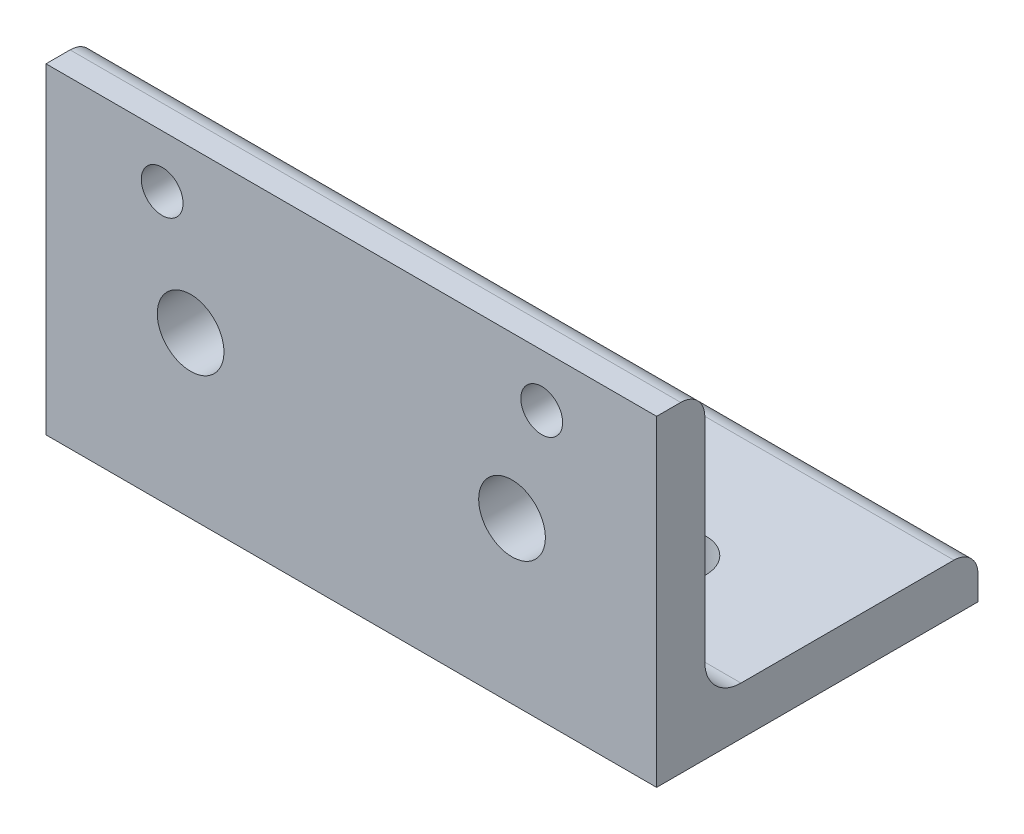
ISO-10303-21;
HEADER;
FILE_DESCRIPTION(('STEP AP214'),'2;1');
FILE_NAME('part.step','',(''),(''),'','','');
FILE_SCHEMA(('AUTOMOTIVE_DESIGN { 1 0 10303 214 1 1 1 1 }'));
ENDSEC;
DATA;
#1=APPLICATION_CONTEXT('core data for automotive mechanical design processes');
#2=APPLICATION_PROTOCOL_DEFINITION('international standard','automotive_design',2000,#1);
#3=PRODUCT_CONTEXT('',#1,'mechanical');
#4=PRODUCT('Part','Part','',(#3));
#5=PRODUCT_RELATED_PRODUCT_CATEGORY('part','',(#4));
#6=PRODUCT_DEFINITION_FORMATION('','',#4);
#7=PRODUCT_DEFINITION_CONTEXT('part definition',#1,'design');
#8=PRODUCT_DEFINITION('design','',#6,#7);
#9=PRODUCT_DEFINITION_SHAPE('','',#8);
#10=(LENGTH_UNIT() NAMED_UNIT(*) SI_UNIT(.MILLI.,.METRE.));
#11=(NAMED_UNIT(*) PLANE_ANGLE_UNIT() SI_UNIT($,.RADIAN.));
#12=(NAMED_UNIT(*) SI_UNIT($,.STERADIAN.) SOLID_ANGLE_UNIT());
#13=UNCERTAINTY_MEASURE_WITH_UNIT(LENGTH_MEASURE(1.E-05),#10,'distance_accuracy_value','');
#14=(GEOMETRIC_REPRESENTATION_CONTEXT(3) GLOBAL_UNCERTAINTY_ASSIGNED_CONTEXT((#13)) GLOBAL_UNIT_ASSIGNED_CONTEXT((#10,
#11,#12)) REPRESENTATION_CONTEXT('',''));
#15=CARTESIAN_POINT('',(0.,0.,0.));
#16=DIRECTION('',(0.,0.,1.));
#17=DIRECTION('',(1.,0.,0.));
#18=AXIS2_PLACEMENT_3D('',#15,#16,#17);
#19=CARTESIAN_POINT('',(0.,5.99999999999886,-5.99999999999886));
#20=DIRECTION('',(0.,-1.,0.));
#21=DIRECTION('',(0.,0.,-1.));
#22=AXIS2_PLACEMENT_3D('',#19,#20,#21);
#23=PLANE('',#22);
#24=CARTESIAN_POINT('',(17.9999999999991,5.99999999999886,-19.9999999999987));
#25=DIRECTION('',(0.,1.,0.));
#26=DIRECTION('',(0.,0.,1.));
#27=AXIS2_PLACEMENT_3D('',#24,#25,#26);
#28=CIRCLE('',#27,4.15000000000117);
#29=CARTESIAN_POINT('',(17.9999999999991,5.99999999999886,-15.8499999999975));
#30=VERTEX_POINT('',#29);
#31=EDGE_CURVE('E210',#30,#30,#28,.T.);
#32=ORIENTED_EDGE('',*,*,#31,.F.);
#33=EDGE_LOOP('',(#32));
#34=FACE_BOUND('',#33,.T.);
#35=DIRECTION('',(0.,0.,-1.));
#36=VECTOR('',#35,1.);
#37=CARTESIAN_POINT('',(76.0000000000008,5.99999999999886,-5.99999999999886));
#38=LINE('',#37,#36);
#39=CARTESIAN_POINT('',(76.0000000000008,5.99999999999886,-10.4999999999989));
#40=VERTEX_POINT('',#39);
#41=CARTESIAN_POINT('',(76.0000000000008,5.99999999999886,-36.999999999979));
#42=VERTEX_POINT('',#41);
#43=EDGE_CURVE('E148',#40,#42,#38,.T.);
#44=ORIENTED_EDGE('',*,*,#43,.T.);
#45=DIRECTION('',(1.,0.,0.));
#46=VECTOR('',#45,1.);
#47=CARTESIAN_POINT('',(0.,5.99999999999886,-36.999999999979));
#48=LINE('',#47,#46);
#49=CARTESIAN_POINT('',(0.,5.99999999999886,-36.999999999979));
#50=VERTEX_POINT('',#49);
#51=EDGE_CURVE('E178',#42,#50,#48,.F.);
#52=ORIENTED_EDGE('',*,*,#51,.T.);
#53=DIRECTION('',(0.,0.,-1.));
#54=VECTOR('',#53,1.);
#55=CARTESIAN_POINT('',(0.,5.99999999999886,-5.99999999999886));
#56=LINE('',#55,#54);
#57=CARTESIAN_POINT('',(0.,5.99999999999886,-10.4999999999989));
#58=VERTEX_POINT('',#57);
#59=EDGE_CURVE('E154',#58,#50,#56,.T.);
#60=ORIENTED_EDGE('',*,*,#59,.F.);
#61=DIRECTION('',(1.,0.,0.));
#62=VECTOR('',#61,1.);
#63=CARTESIAN_POINT('',(76.0000000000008,5.99999999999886,-10.4999999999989));
#64=LINE('',#63,#62);
#65=EDGE_CURVE('E159',#58,#40,#64,.T.);
#66=ORIENTED_EDGE('',*,*,#65,.T.);
#67=EDGE_LOOP('',(#44,#52,#60,#66));
#68=FACE_BOUND('',#67,.T.);
#69=CARTESIAN_POINT('',(57.9999999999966,5.99999999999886,-19.9999999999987));
#70=DIRECTION('',(0.,1.,0.));
#71=DIRECTION('',(0.,0.,1.));
#72=AXIS2_PLACEMENT_3D('',#69,#70,#71);
#73=CIRCLE('',#72,4.15000000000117);
#74=CARTESIAN_POINT('',(57.9999999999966,5.99999999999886,-15.8499999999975));
#75=VERTEX_POINT('',#74);
#76=EDGE_CURVE('E216',#75,#75,#73,.T.);
#77=ORIENTED_EDGE('',*,*,#76,.F.);
#78=EDGE_LOOP('',(#77));
#79=FACE_BOUND('',#78,.T.);
#80=ADVANCED_FACE('F45',(#34,#68,#79),#23,.F.);
#81=CARTESIAN_POINT('',(0.,0.,-39.9999999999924));
#82=DIRECTION('',(0.,-1.,0.));
#83=DIRECTION('',(0.,0.,-1.));
#84=AXIS2_PLACEMENT_3D('',#81,#82,#83);
#85=PLANE('',#84);
#86=CARTESIAN_POINT('',(17.9999999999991,0.,-19.9999999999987));
#87=DIRECTION('',(0.,1.,0.));
#88=DIRECTION('',(0.,0.,1.));
#89=AXIS2_PLACEMENT_3D('',#86,#87,#88);
#90=CIRCLE('',#89,4.15000000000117);
#91=CARTESIAN_POINT('',(17.9999999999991,0.,-15.8499999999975));
#92=VERTEX_POINT('',#91);
#93=EDGE_CURVE('E213',#92,#92,#90,.T.);
#94=ORIENTED_EDGE('',*,*,#93,.T.);
#95=EDGE_LOOP('',(#94));
#96=FACE_BOUND('',#95,.T.);
#97=CARTESIAN_POINT('',(57.9999999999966,0.,-19.9999999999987));
#98=DIRECTION('',(0.,1.,0.));
#99=DIRECTION('',(0.,0.,1.));
#100=AXIS2_PLACEMENT_3D('',#97,#98,#99);
#101=CIRCLE('',#100,4.15000000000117);
#102=CARTESIAN_POINT('',(57.9999999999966,0.,-15.8499999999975));
#103=VERTEX_POINT('',#102);
#104=EDGE_CURVE('E219',#103,#103,#101,.T.);
#105=ORIENTED_EDGE('',*,*,#104,.T.);
#106=EDGE_LOOP('',(#105));
#107=FACE_BOUND('',#106,.T.);
#108=DIRECTION('',(1.,0.,0.));
#109=VECTOR('',#108,1.);
#110=CARTESIAN_POINT('',(0.,0.,0.));
#111=LINE('',#110,#109);
#112=CARTESIAN_POINT('',(0.,0.,0.));
#113=VERTEX_POINT('',#112);
#114=CARTESIAN_POINT('',(76.0000000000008,0.,0.));
#115=VERTEX_POINT('',#114);
#116=EDGE_CURVE('E152',#113,#115,#111,.T.);
#117=ORIENTED_EDGE('',*,*,#116,.F.);
#118=DIRECTION('',(0.,0.,1.));
#119=VECTOR('',#118,1.);
#120=CARTESIAN_POINT('',(0.,0.,-39.9999999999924));
#121=LINE('',#120,#119);
#122=CARTESIAN_POINT('',(0.,0.,-39.9999999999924));
#123=VERTEX_POINT('',#122);
#124=EDGE_CURVE('E141',#123,#113,#121,.T.);
#125=ORIENTED_EDGE('',*,*,#124,.F.);
#126=DIRECTION('',(1.,0.,0.));
#127=VECTOR('',#126,1.);
#128=CARTESIAN_POINT('',(0.,0.,-39.9999999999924));
#129=LINE('',#128,#127);
#130=CARTESIAN_POINT('',(76.0000000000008,0.,-39.9999999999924));
#131=VERTEX_POINT('',#130);
#132=EDGE_CURVE('E135',#123,#131,#129,.T.);
#133=ORIENTED_EDGE('',*,*,#132,.T.);
#134=DIRECTION('',(0.,0.,1.));
#135=VECTOR('',#134,1.);
#136=CARTESIAN_POINT('',(76.0000000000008,0.,-39.9999999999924));
#137=LINE('',#136,#135);
#138=EDGE_CURVE('E117',#131,#115,#137,.T.);
#139=ORIENTED_EDGE('',*,*,#138,.T.);
#140=EDGE_LOOP('',(#117,#125,#133,#139));
#141=FACE_BOUND('',#140,.T.);
#142=ADVANCED_FACE('F140',(#96,#107,#141),#85,.T.);
#143=CARTESIAN_POINT('',(0.,39.9999999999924,-39.9999999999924));
#144=DIRECTION('',(-1.,0.,0.));
#145=DIRECTION('',(0.,0.,1.));
#146=AXIS2_PLACEMENT_3D('',#143,#144,#145);
#147=PLANE('',#146);
#148=ORIENTED_EDGE('',*,*,#59,.T.);
#149=CARTESIAN_POINT('',(0.,2.99999999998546,-36.999999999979));
#150=DIRECTION('',(-1.,0.,0.));
#151=DIRECTION('',(0.,0.,1.));
#152=AXIS2_PLACEMENT_3D('',#149,#150,#151);
#153=CIRCLE('',#152,3.0000000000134);
#154=CARTESIAN_POINT('',(0.,2.99999999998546,-39.9999999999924));
#155=VERTEX_POINT('',#154);
#156=EDGE_CURVE('E181',#50,#155,#153,.T.);
#157=ORIENTED_EDGE('',*,*,#156,.T.);
#158=DIRECTION('',(0.,-1.,0.));
#159=VECTOR('',#158,1.);
#160=CARTESIAN_POINT('',(0.,39.9999999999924,-39.9999999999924));
#161=LINE('',#160,#159);
#162=EDGE_CURVE('E128',#155,#123,#161,.T.);
#163=ORIENTED_EDGE('',*,*,#162,.T.);
#164=ORIENTED_EDGE('',*,*,#124,.T.);
#165=DIRECTION('',(0.,-1.,0.));
#166=VECTOR('',#165,1.);
#167=CARTESIAN_POINT('',(0.,39.9999999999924,0.));
#168=LINE('',#167,#166);
#169=CARTESIAN_POINT('',(0.,39.9999999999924,0.));
#170=VERTEX_POINT('',#169);
#171=EDGE_CURVE('E142',#170,#113,#168,.T.);
#172=ORIENTED_EDGE('',*,*,#171,.F.);
#173=DIRECTION('',(0.,0.,1.));
#174=VECTOR('',#173,1.);
#175=CARTESIAN_POINT('',(0.,39.9999999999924,-39.9999999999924));
#176=LINE('',#175,#174);
#177=CARTESIAN_POINT('',(0.,39.9999999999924,-2.99999999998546));
#178=VERTEX_POINT('',#177);
#179=EDGE_CURVE('E160',#178,#170,#176,.T.);
#180=ORIENTED_EDGE('',*,*,#179,.F.);
#181=CARTESIAN_POINT('',(0.,36.999999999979,-2.99999999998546));
#182=DIRECTION('',(-1.,0.,0.));
#183=DIRECTION('',(0.,0.,1.));
#184=AXIS2_PLACEMENT_3D('',#181,#182,#183);
#185=CIRCLE('',#184,3.0000000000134);
#186=CARTESIAN_POINT('',(0.,36.999999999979,-5.99999999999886));
#187=VERTEX_POINT('',#186);
#188=EDGE_CURVE('E67',#178,#187,#185,.T.);
#189=ORIENTED_EDGE('',*,*,#188,.T.);
#190=DIRECTION('',(0.,-1.,0.));
#191=VECTOR('',#190,1.);
#192=CARTESIAN_POINT('',(0.,39.9999999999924,-5.99999999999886));
#193=LINE('',#192,#191);
#194=CARTESIAN_POINT('',(0.,10.4999999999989,-5.99999999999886));
#195=VERTEX_POINT('',#194);
#196=EDGE_CURVE('E223',#187,#195,#193,.T.);
#197=ORIENTED_EDGE('',*,*,#196,.T.);
#198=CARTESIAN_POINT('',(0.,10.4999999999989,-10.4999999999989));
#199=DIRECTION('',(-1.,0.,0.));
#200=DIRECTION('',(0.,0.,1.));
#201=AXIS2_PLACEMENT_3D('',#198,#199,#200);
#202=CIRCLE('',#201,4.5);
#203=EDGE_CURVE('E171',#195,#58,#202,.F.);
#204=ORIENTED_EDGE('',*,*,#203,.T.);
#205=EDGE_LOOP('',(#148,#157,#163,#164,#172,#180,#189,#197,#204));
#206=FACE_BOUND('',#205,.T.);
#207=ADVANCED_FACE('F238',(#206),#147,.T.);
#208=CARTESIAN_POINT('',(76.0000000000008,39.9999999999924,-39.9999999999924));
#209=DIRECTION('',(0.,1.,0.));
#210=DIRECTION('',(0.,0.,1.));
#211=AXIS2_PLACEMENT_3D('',#208,#209,#210);
#212=PLANE('',#211);
#213=DIRECTION('',(0.,0.,1.));
#214=VECTOR('',#213,1.);
#215=CARTESIAN_POINT('',(76.0000000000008,39.9999999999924,-39.9999999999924));
#216=LINE('',#215,#214);
#217=CARTESIAN_POINT('',(76.0000000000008,39.9999999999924,-2.99999999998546));
#218=VERTEX_POINT('',#217);
#219=CARTESIAN_POINT('',(76.0000000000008,39.9999999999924,0.));
#220=VERTEX_POINT('',#219);
#221=EDGE_CURVE('E127',#218,#220,#216,.T.);
#222=ORIENTED_EDGE('',*,*,#221,.F.);
#223=DIRECTION('',(1.,0.,0.));
#224=VECTOR('',#223,1.);
#225=CARTESIAN_POINT('',(0.,39.9999999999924,-2.99999999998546));
#226=LINE('',#225,#224);
#227=EDGE_CURVE('E11',#218,#178,#226,.F.);
#228=ORIENTED_EDGE('',*,*,#227,.T.);
#229=ORIENTED_EDGE('',*,*,#179,.T.);
#230=DIRECTION('',(-1.,0.,0.));
#231=VECTOR('',#230,1.);
#232=CARTESIAN_POINT('',(76.0000000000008,39.9999999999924,0.));
#233=LINE('',#232,#231);
#234=EDGE_CURVE('E145',#220,#170,#233,.T.);
#235=ORIENTED_EDGE('',*,*,#234,.F.);
#236=EDGE_LOOP('',(#222,#228,#229,#235));
#237=FACE_BOUND('',#236,.T.);
#238=ADVANCED_FACE('F246',(#237),#212,.T.);
#239=CARTESIAN_POINT('',(76.0000000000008,0.,-39.9999999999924));
#240=DIRECTION('',(1.,0.,0.));
#241=DIRECTION('',(0.,0.,-1.));
#242=AXIS2_PLACEMENT_3D('',#239,#240,#241);
#243=PLANE('',#242);
#244=DIRECTION('',(0.,1.,0.));
#245=VECTOR('',#244,1.);
#246=CARTESIAN_POINT('',(76.0000000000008,0.,-39.9999999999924));
#247=LINE('',#246,#245);
#248=CARTESIAN_POINT('',(76.0000000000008,2.99999999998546,-39.9999999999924));
#249=VERTEX_POINT('',#248);
#250=EDGE_CURVE('E120',#131,#249,#247,.T.);
#251=ORIENTED_EDGE('',*,*,#250,.T.);
#252=CARTESIAN_POINT('',(76.0000000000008,2.99999999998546,-36.999999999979));
#253=DIRECTION('',(1.,0.,0.));
#254=DIRECTION('',(0.,0.,-1.));
#255=AXIS2_PLACEMENT_3D('',#252,#253,#254);
#256=CIRCLE('',#255,3.0000000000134);
#257=EDGE_CURVE('E176',#249,#42,#256,.T.);
#258=ORIENTED_EDGE('',*,*,#257,.T.);
#259=ORIENTED_EDGE('',*,*,#43,.F.);
#260=CARTESIAN_POINT('',(76.0000000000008,10.4999999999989,-10.4999999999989));
#261=DIRECTION('',(1.,0.,0.));
#262=DIRECTION('',(0.,0.,-1.));
#263=AXIS2_PLACEMENT_3D('',#260,#261,#262);
#264=CIRCLE('',#263,4.5);
#265=CARTESIAN_POINT('',(76.0000000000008,10.4999999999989,-5.99999999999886));
#266=VERTEX_POINT('',#265);
#267=EDGE_CURVE('E168',#40,#266,#264,.F.);
#268=ORIENTED_EDGE('',*,*,#267,.T.);
#269=DIRECTION('',(0.,-1.,0.));
#270=VECTOR('',#269,1.);
#271=CARTESIAN_POINT('',(76.0000000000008,39.9999999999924,-5.99999999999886));
#272=LINE('',#271,#270);
#273=CARTESIAN_POINT('',(76.0000000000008,36.999999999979,-5.99999999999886));
#274=VERTEX_POINT('',#273);
#275=EDGE_CURVE('E222',#274,#266,#272,.T.);
#276=ORIENTED_EDGE('',*,*,#275,.F.);
#277=CARTESIAN_POINT('',(76.0000000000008,36.999999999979,-2.99999999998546));
#278=DIRECTION('',(1.,0.,0.));
#279=DIRECTION('',(0.,0.,-1.));
#280=AXIS2_PLACEMENT_3D('',#277,#278,#279);
#281=CIRCLE('',#280,3.0000000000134);
#282=EDGE_CURVE('E174',#274,#218,#281,.T.);
#283=ORIENTED_EDGE('',*,*,#282,.T.);
#284=ORIENTED_EDGE('',*,*,#221,.T.);
#285=DIRECTION('',(0.,1.,0.));
#286=VECTOR('',#285,1.);
#287=CARTESIAN_POINT('',(76.0000000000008,0.,0.));
#288=LINE('',#287,#286);
#289=EDGE_CURVE('E122',#115,#220,#288,.T.);
#290=ORIENTED_EDGE('',*,*,#289,.F.);
#291=ORIENTED_EDGE('',*,*,#138,.F.);
#292=EDGE_LOOP('',(#251,#258,#259,#268,#276,#283,#284,#290,#291));
#293=FACE_BOUND('',#292,.T.);
#294=ADVANCED_FACE('F119',(#293),#243,.T.);
#295=CARTESIAN_POINT('',(0.,0.,-39.9999999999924));
#296=DIRECTION('',(0.,0.,1.));
#297=DIRECTION('',(1.,0.,0.));
#298=AXIS2_PLACEMENT_3D('',#295,#296,#297);
#299=PLANE('',#298);
#300=ORIENTED_EDGE('',*,*,#162,.F.);
#301=DIRECTION('',(1.,0.,0.));
#302=VECTOR('',#301,1.);
#303=CARTESIAN_POINT('',(0.,2.99999999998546,-39.9999999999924));
#304=LINE('',#303,#302);
#305=EDGE_CURVE('E137',#155,#249,#304,.T.);
#306=ORIENTED_EDGE('',*,*,#305,.T.);
#307=ORIENTED_EDGE('',*,*,#250,.F.);
#308=ORIENTED_EDGE('',*,*,#132,.F.);
#309=EDGE_LOOP('',(#300,#306,#307,#308));
#310=FACE_BOUND('',#309,.T.);
#311=ADVANCED_FACE('F134',(#310),#299,.F.);
#312=CARTESIAN_POINT('',(0.,0.,0.));
#313=DIRECTION('',(0.,0.,1.));
#314=DIRECTION('',(1.,0.,0.));
#315=AXIS2_PLACEMENT_3D('',#312,#313,#314);
#316=PLANE('',#315);
#317=CARTESIAN_POINT('',(14.4595506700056,33.4759999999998,0.));
#318=DIRECTION('',(0.,0.,1.));
#319=DIRECTION('',(1.,0.,0.));
#320=AXIS2_PLACEMENT_3D('',#317,#318,#319);
#321=CIRCLE('',#320,2.60000000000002);
#322=CARTESIAN_POINT('',(17.0595506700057,33.4759999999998,0.));
#323=VERTEX_POINT('',#322);
#324=EDGE_CURVE('E186',#323,#323,#321,.T.);
#325=ORIENTED_EDGE('',*,*,#324,.F.);
#326=EDGE_LOOP('',(#325));
#327=FACE_BOUND('',#326,.T.);
#328=CARTESIAN_POINT('',(61.6995506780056,33.4760000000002,0.));
#329=DIRECTION('',(0.,0.,1.));
#330=DIRECTION('',(1.,0.,0.));
#331=AXIS2_PLACEMENT_3D('',#328,#329,#330);
#332=CIRCLE('',#331,2.60000000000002);
#333=CARTESIAN_POINT('',(64.2995506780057,33.4760000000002,0.));
#334=VERTEX_POINT('',#333);
#335=EDGE_CURVE('E192',#334,#334,#332,.T.);
#336=ORIENTED_EDGE('',*,*,#335,.F.);
#337=EDGE_LOOP('',(#336));
#338=FACE_BOUND('',#337,.T.);
#339=CARTESIAN_POINT('',(57.9999999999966,19.9999999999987,0.));
#340=DIRECTION('',(0.,0.,-1.));
#341=DIRECTION('',(-1.,0.,0.));
#342=AXIS2_PLACEMENT_3D('',#339,#340,#341);
#343=CIRCLE('',#342,4.15000000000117);
#344=CARTESIAN_POINT('',(53.8499999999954,19.9999999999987,0.));
#345=VERTEX_POINT('',#344);
#346=EDGE_CURVE('E201',#345,#345,#343,.T.);
#347=ORIENTED_EDGE('',*,*,#346,.T.);
#348=EDGE_LOOP('',(#347));
#349=FACE_BOUND('',#348,.T.);
#350=CARTESIAN_POINT('',(17.9999999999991,19.9999999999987,0.));
#351=DIRECTION('',(0.,0.,-1.));
#352=DIRECTION('',(-1.,0.,0.));
#353=AXIS2_PLACEMENT_3D('',#350,#351,#352);
#354=CIRCLE('',#353,4.15000000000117);
#355=CARTESIAN_POINT('',(13.8499999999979,19.9999999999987,0.));
#356=VERTEX_POINT('',#355);
#357=EDGE_CURVE('E207',#356,#356,#354,.T.);
#358=ORIENTED_EDGE('',*,*,#357,.T.);
#359=EDGE_LOOP('',(#358));
#360=FACE_BOUND('',#359,.T.);
#361=ORIENTED_EDGE('',*,*,#116,.T.);
#362=ORIENTED_EDGE('',*,*,#289,.T.);
#363=ORIENTED_EDGE('',*,*,#234,.T.);
#364=ORIENTED_EDGE('',*,*,#171,.T.);
#365=EDGE_LOOP('',(#361,#362,#363,#364));
#366=FACE_BOUND('',#365,.T.);
#367=ADVANCED_FACE('F250',(#327,#338,#349,#360,#366),#316,.T.);
#368=CARTESIAN_POINT('',(0.,39.9999999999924,-5.99999999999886));
#369=DIRECTION('',(0.,0.,1.));
#370=DIRECTION('',(1.,0.,0.));
#371=AXIS2_PLACEMENT_3D('',#368,#369,#370);
#372=PLANE('',#371);
#373=CARTESIAN_POINT('',(14.4595506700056,33.4759999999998,-5.99999999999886));
#374=DIRECTION('',(0.,0.,1.));
#375=DIRECTION('',(1.,0.,0.));
#376=AXIS2_PLACEMENT_3D('',#373,#374,#375);
#377=CIRCLE('',#376,2.60000000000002);
#378=CARTESIAN_POINT('',(17.0595506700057,33.4759999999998,-5.99999999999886));
#379=VERTEX_POINT('',#378);
#380=EDGE_CURVE('E49',#379,#379,#377,.T.);
#381=ORIENTED_EDGE('',*,*,#380,.T.);
#382=EDGE_LOOP('',(#381));
#383=FACE_BOUND('',#382,.T.);
#384=CARTESIAN_POINT('',(61.6995506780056,33.4760000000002,-5.99999999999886));
#385=DIRECTION('',(0.,0.,1.));
#386=DIRECTION('',(1.,0.,0.));
#387=AXIS2_PLACEMENT_3D('',#384,#385,#386);
#388=CIRCLE('',#387,2.60000000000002);
#389=CARTESIAN_POINT('',(64.2995506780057,33.4760000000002,-5.99999999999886));
#390=VERTEX_POINT('',#389);
#391=EDGE_CURVE('E184',#390,#390,#388,.T.);
#392=ORIENTED_EDGE('',*,*,#391,.T.);
#393=EDGE_LOOP('',(#392));
#394=FACE_BOUND('',#393,.T.);
#395=CARTESIAN_POINT('',(57.9999999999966,19.9999999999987,-5.99999999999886));
#396=DIRECTION('',(0.,0.,-1.));
#397=DIRECTION('',(-1.,0.,0.));
#398=AXIS2_PLACEMENT_3D('',#395,#396,#397);
#399=CIRCLE('',#398,4.15000000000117);
#400=CARTESIAN_POINT('',(53.8499999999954,19.9999999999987,-5.99999999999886));
#401=VERTEX_POINT('',#400);
#402=EDGE_CURVE('E190',#401,#401,#399,.T.);
#403=ORIENTED_EDGE('',*,*,#402,.F.);
#404=EDGE_LOOP('',(#403));
#405=FACE_BOUND('',#404,.T.);
#406=CARTESIAN_POINT('',(17.9999999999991,19.9999999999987,-5.99999999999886));
#407=DIRECTION('',(0.,0.,-1.));
#408=DIRECTION('',(-1.,0.,0.));
#409=AXIS2_PLACEMENT_3D('',#406,#407,#408);
#410=CIRCLE('',#409,4.15000000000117);
#411=CARTESIAN_POINT('',(13.8499999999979,19.9999999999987,-5.99999999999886));
#412=VERTEX_POINT('',#411);
#413=EDGE_CURVE('E204',#412,#412,#410,.T.);
#414=ORIENTED_EDGE('',*,*,#413,.F.);
#415=EDGE_LOOP('',(#414));
#416=FACE_BOUND('',#415,.T.);
#417=ORIENTED_EDGE('',*,*,#196,.F.);
#418=DIRECTION('',(1.,0.,0.));
#419=VECTOR('',#418,1.);
#420=CARTESIAN_POINT('',(76.0000000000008,36.999999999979,-5.99999999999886));
#421=LINE('',#420,#419);
#422=EDGE_CURVE('E54',#187,#274,#421,.T.);
#423=ORIENTED_EDGE('',*,*,#422,.T.);
#424=ORIENTED_EDGE('',*,*,#275,.T.);
#425=DIRECTION('',(1.,0.,0.));
#426=VECTOR('',#425,1.);
#427=CARTESIAN_POINT('',(0.,10.4999999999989,-5.99999999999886));
#428=LINE('',#427,#426);
#429=EDGE_CURVE('E165',#266,#195,#428,.F.);
#430=ORIENTED_EDGE('',*,*,#429,.T.);
#431=EDGE_LOOP('',(#417,#423,#424,#430));
#432=FACE_BOUND('',#431,.T.);
#433=ADVANCED_FACE('F247',(#383,#394,#405,#416,#432),#372,.F.);
#434=CARTESIAN_POINT('',(57.9999999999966,5.99999999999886,-19.9999999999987));
#435=DIRECTION('',(0.,1.,0.));
#436=DIRECTION('',(0.,0.,1.));
#437=AXIS2_PLACEMENT_3D('',#434,#435,#436);
#438=CYLINDRICAL_SURFACE('',#437,4.15000000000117);
#439=ORIENTED_EDGE('',*,*,#104,.F.);
#440=EDGE_LOOP('',(#439));
#441=FACE_BOUND('',#440,.T.);
#442=ORIENTED_EDGE('',*,*,#76,.T.);
#443=EDGE_LOOP('',(#442));
#444=FACE_BOUND('',#443,.T.);
#445=ADVANCED_FACE('F249',(#441,#444),#438,.F.);
#446=CARTESIAN_POINT('',(17.9999999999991,5.99999999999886,-19.9999999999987));
#447=DIRECTION('',(0.,1.,0.));
#448=DIRECTION('',(0.,0.,1.));
#449=AXIS2_PLACEMENT_3D('',#446,#447,#448);
#450=CYLINDRICAL_SURFACE('',#449,4.15000000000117);
#451=ORIENTED_EDGE('',*,*,#93,.F.);
#452=EDGE_LOOP('',(#451));
#453=FACE_BOUND('',#452,.T.);
#454=ORIENTED_EDGE('',*,*,#31,.T.);
#455=EDGE_LOOP('',(#454));
#456=FACE_BOUND('',#455,.T.);
#457=ADVANCED_FACE('F258',(#453,#456),#450,.F.);
#458=CARTESIAN_POINT('',(17.9999999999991,19.9999999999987,-5.99999999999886));
#459=DIRECTION('',(0.,0.,-1.));
#460=DIRECTION('',(-1.,0.,0.));
#461=AXIS2_PLACEMENT_3D('',#458,#459,#460);
#462=CYLINDRICAL_SURFACE('',#461,4.15000000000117);
#463=ORIENTED_EDGE('',*,*,#357,.F.);
#464=EDGE_LOOP('',(#463));
#465=FACE_BOUND('',#464,.T.);
#466=ORIENTED_EDGE('',*,*,#413,.T.);
#467=EDGE_LOOP('',(#466));
#468=FACE_BOUND('',#467,.T.);
#469=ADVANCED_FACE('F278',(#465,#468),#462,.F.);
#470=CARTESIAN_POINT('',(57.9999999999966,19.9999999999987,-5.99999999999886));
#471=DIRECTION('',(0.,0.,-1.));
#472=DIRECTION('',(-1.,0.,0.));
#473=AXIS2_PLACEMENT_3D('',#470,#471,#472);
#474=CYLINDRICAL_SURFACE('',#473,4.15000000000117);
#475=ORIENTED_EDGE('',*,*,#346,.F.);
#476=EDGE_LOOP('',(#475));
#477=FACE_BOUND('',#476,.T.);
#478=ORIENTED_EDGE('',*,*,#402,.T.);
#479=EDGE_LOOP('',(#478));
#480=FACE_BOUND('',#479,.T.);
#481=ADVANCED_FACE('F282',(#477,#480),#474,.F.);
#482=CARTESIAN_POINT('',(0.,10.4999999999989,-10.4999999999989));
#483=DIRECTION('',(-1.,0.,0.));
#484=DIRECTION('',(0.,0.,1.));
#485=AXIS2_PLACEMENT_3D('',#482,#483,#484);
#486=CYLINDRICAL_SURFACE('',#485,4.5);
#487=ORIENTED_EDGE('',*,*,#203,.F.);
#488=ORIENTED_EDGE('',*,*,#429,.F.);
#489=ORIENTED_EDGE('',*,*,#267,.F.);
#490=ORIENTED_EDGE('',*,*,#65,.F.);
#491=EDGE_LOOP('',(#487,#488,#489,#490));
#492=FACE_BOUND('',#491,.T.);
#493=ADVANCED_FACE('F241',(#492),#486,.F.);
#494=CARTESIAN_POINT('',(0.,2.99999999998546,-36.999999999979));
#495=DIRECTION('',(1.,0.,0.));
#496=DIRECTION('',(0.,0.,-1.));
#497=AXIS2_PLACEMENT_3D('',#494,#495,#496);
#498=CYLINDRICAL_SURFACE('',#497,3.0000000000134);
#499=ORIENTED_EDGE('',*,*,#156,.F.);
#500=ORIENTED_EDGE('',*,*,#51,.F.);
#501=ORIENTED_EDGE('',*,*,#257,.F.);
#502=ORIENTED_EDGE('',*,*,#305,.F.);
#503=EDGE_LOOP('',(#499,#500,#501,#502));
#504=FACE_BOUND('',#503,.T.);
#505=ADVANCED_FACE('F237',(#504),#498,.T.);
#506=CARTESIAN_POINT('',(0.,36.999999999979,-2.99999999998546));
#507=DIRECTION('',(-1.,0.,0.));
#508=DIRECTION('',(0.,0.,1.));
#509=AXIS2_PLACEMENT_3D('',#506,#507,#508);
#510=CYLINDRICAL_SURFACE('',#509,3.0000000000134);
#511=ORIENTED_EDGE('',*,*,#188,.F.);
#512=ORIENTED_EDGE('',*,*,#227,.F.);
#513=ORIENTED_EDGE('',*,*,#282,.F.);
#514=ORIENTED_EDGE('',*,*,#422,.F.);
#515=EDGE_LOOP('',(#511,#512,#513,#514));
#516=FACE_BOUND('',#515,.T.);
#517=ADVANCED_FACE('F47',(#516),#510,.T.);
#518=CARTESIAN_POINT('',(61.6995506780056,33.4760000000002,-39.9999999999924));
#519=DIRECTION('',(0.,0.,1.));
#520=DIRECTION('',(1.,0.,0.));
#521=AXIS2_PLACEMENT_3D('',#518,#519,#520);
#522=CYLINDRICAL_SURFACE('',#521,2.60000000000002);
#523=ORIENTED_EDGE('',*,*,#335,.T.);
#524=EDGE_LOOP('',(#523));
#525=FACE_BOUND('',#524,.T.);
#526=ORIENTED_EDGE('',*,*,#391,.F.);
#527=EDGE_LOOP('',(#526));
#528=FACE_BOUND('',#527,.T.);
#529=ADVANCED_FACE('F287',(#525,#528),#522,.F.);
#530=CARTESIAN_POINT('',(14.4595506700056,33.4759999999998,-39.9999999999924));
#531=DIRECTION('',(0.,0.,1.));
#532=DIRECTION('',(1.,0.,0.));
#533=AXIS2_PLACEMENT_3D('',#530,#531,#532);
#534=CYLINDRICAL_SURFACE('',#533,2.60000000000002);
#535=ORIENTED_EDGE('',*,*,#324,.T.);
#536=EDGE_LOOP('',(#535));
#537=FACE_BOUND('',#536,.T.);
#538=ORIENTED_EDGE('',*,*,#380,.F.);
#539=EDGE_LOOP('',(#538));
#540=FACE_BOUND('',#539,.T.);
#541=ADVANCED_FACE('F289',(#537,#540),#534,.F.);
#542=CLOSED_SHELL('',(#80,#142,#207,#238,#294,#311,#367,#433,#445,#457,#469,#481,#493,#505,#517,
#529,#541));
#543=MANIFOLD_SOLID_BREP('B2',#542);
#544=ADVANCED_BREP_SHAPE_REPRESENTATION('',(#18,#543),#14);
#545=SHAPE_DEFINITION_REPRESENTATION(#9,#544);
ENDSEC;
END-ISO-10303-21;
